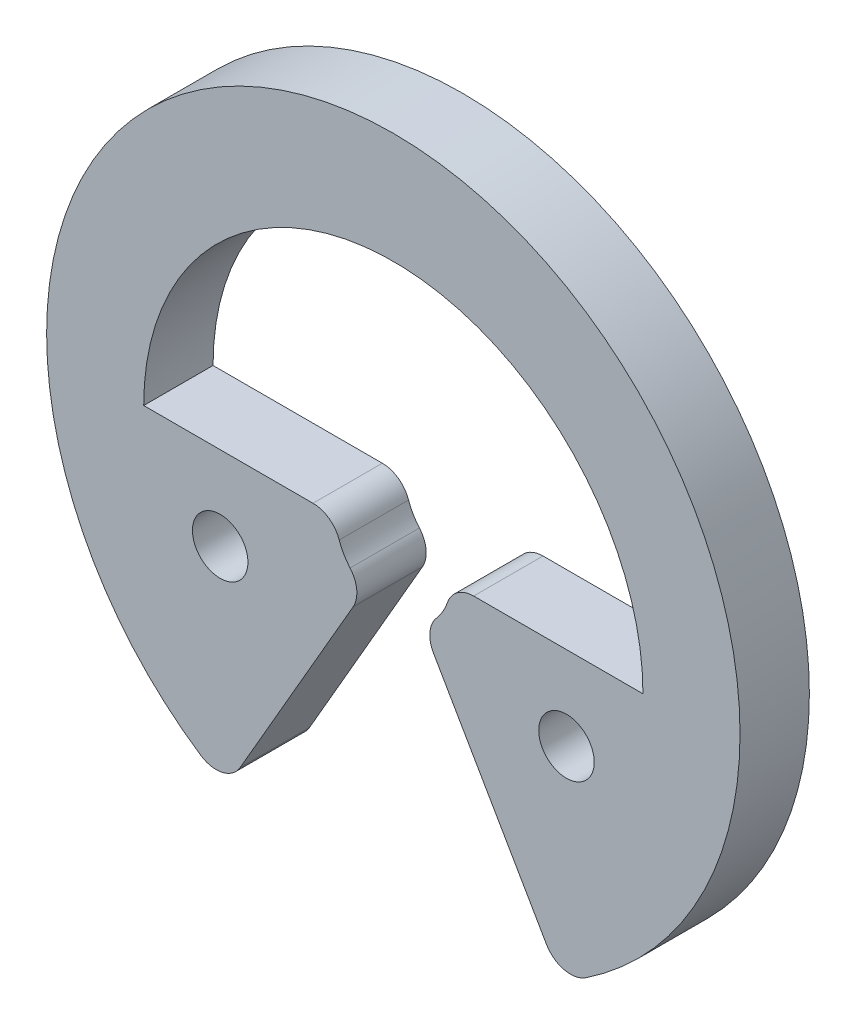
from build123d import *

# Parameters (mm, degrees)
ESQUISSE1_R          = 0.2
BASE_EXTRUSION_DEPTH = 0.5


with BuildPart() as part:
    # Esquisse1 → Base-Extrusion (new body)
    with BuildSketch(Plane.XY):
        with BuildLine():
            Line((1.104250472, -1.912617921), (0.289673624, -0.501729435))
            ThreePointArc((0.289673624, -0.501729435), (0.26379187, -0.38263933), (0.311832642, -0.270637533))
            ThreePointArc((0.311832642, -0.270637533), (0.357579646, -0.206448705), (0.3902953, -0.134736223))
            ThreePointArc((0.3902953, -0.134736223), (0.463271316, -0.037130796), (0.579347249, 0))
            Line((0.579347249, 0), (1.8, 0))
            ThreePointArc((1.8, 0), (0, 1.8), (-1.8, 0))
            Line((-1.8, 0), (-0.579347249, 0))
            ThreePointArc((-0.579347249, 0), (-0.463271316, -0.037130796), (-0.3902953, -0.134736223))
            ThreePointArc((-0.3902953, -0.134736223), (-0.357579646, -0.206448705), (-0.311832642, -0.270637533))
            ThreePointArc((-0.311832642, -0.270637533), (-0.26379187, -0.38263933), (-0.289673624, -0.501729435))
            Line((-0.289673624, -0.501729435), (-1.104250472, -1.912617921))
            ThreePointArc((-1.104250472, -1.912617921), (-1.232022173, -2.007389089), (-1.388538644, -1.978932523))
            ThreePointArc((-1.388538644, -1.978932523), (0, 2.6), (1.388538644, -1.978932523))
            ThreePointArc((1.388538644, -1.978932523), (1.232022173, -2.007389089), (1.104250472, -1.912617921))
        make_face()
        with Locations((-1.248481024, -0.603586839)):
            Circle(ESQUISSE1_R, mode=Mode.SUBTRACT)
        with Locations(Location((1.248481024, -0.603586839, 0), (0, 0, 180))):
            Circle(ESQUISSE1_R, mode=Mode.SUBTRACT)
    extrude(amount=BASE_EXTRUSION_DEPTH)


solid = part.part
